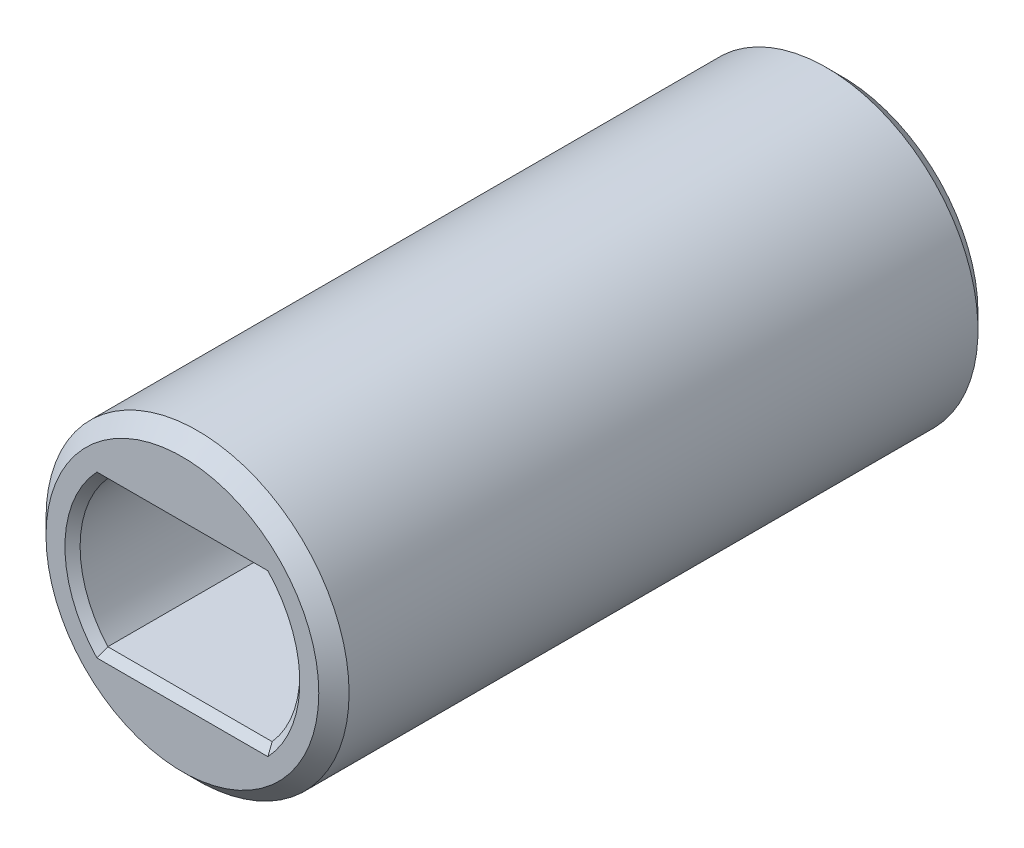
from build123d import *

# Parameters (mm, degrees)
SKICA1_R                 = 4
P_IDAT_VYSUNUT_M1_DEPTH  = 8.4
P_IDAT_START             = 9
SKICA2_R                 = 4
P_IDAT_VYSUNUT_M2_DEPTH  = 9
SKICA3_R                 = 3
ODEBRAT_VYSUNUT_M1_DEPTH = 8
SKICA4_W                 = 0.8
SKICA4_H                 = 7.959899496
P_IDAT_VYSUNUT_M3_DEPTH  = 6
ZKOSEN_1_SIZE            = 0.2
ZKOSEN_2_SIZE            = 0.2
ZKOSEN_3_SIZE            = 0.4


with BuildPart() as part:
    # Skica1 → P_idat vysunut_m1 (new body)
    with BuildSketch(Plane.XY):
        Circle(SKICA1_R)
        with BuildLine():
            Line((-2.168957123, 1.925), (2.168957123, 1.925))
            ThreePointArc((2.168957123, 1.925), (2.9, 0), (2.168957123, -1.925))
            Line((2.168957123, -1.925), (-2.168957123, -1.925))
            ThreePointArc((-2.168957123, -1.925), (-2.9, 0), (-2.168957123, 1.925))
        make_face(mode=Mode.SUBTRACT)
    extrude(amount=P_IDAT_VYSUNUT_M1_DEPTH)

    # Skica2 → P_idat vysunut_m2 (add)
    with BuildSketch(Plane(origin=(0, 0, 0), x_dir=(-1, 0, 0), z_dir=(0, 0, -1)).offset(P_IDAT_START)):
        Circle(SKICA2_R)
    extrude(amount=-P_IDAT_VYSUNUT_M2_DEPTH)

    # Skica3 → Odebrat vysunut_m1 (cut)
    with BuildSketch(Plane(origin=(0, 0, -9), x_dir=(-1, 0, 0), z_dir=(0, 0, -1))):
        Circle(SKICA3_R)
    extrude(amount=-ODEBRAT_VYSUNUT_M1_DEPTH, mode=Mode.SUBTRACT)

    # Skica4 → P_idat vysunut_m3 (add)
    with BuildSketch(Plane(origin=(0, 0, -1), x_dir=(-1, 0, 0), z_dir=(0, 0, -1))):
        Rectangle(SKICA4_W, SKICA4_H)
    extrude(amount=P_IDAT_VYSUNUT_M3_DEPTH)

    # Zkosen_1
    zkosen_1_edges = [part.edges().sort_by_distance(p)[0] for p in [
        (0.4, 0, -7),
        (-0.4, 0, -7),
    ]]
    chamfer(zkosen_1_edges, length=ZKOSEN_1_SIZE)

    # Zkosen_2
    zkosen_2_edges = [part.edges().sort_by_distance(p)[0] for p in [
        (0, 1.925, 8.4),
        (3, 0, -9),
        (-2.9, 0, 8.4),
        (0, -1.925, 8.4),
        (2.9, 0, 8.4),
    ]]
    chamfer(zkosen_2_edges, length=ZKOSEN_2_SIZE)

    # Zkosen_3
    zkosen_3_edges = [part.edges().sort_by_distance(p)[0] for p in [
        (4, 0, -9),
        (-4, 0, 8.4),
    ]]
    chamfer(zkosen_3_edges, length=ZKOSEN_3_SIZE)


solid = part.part
